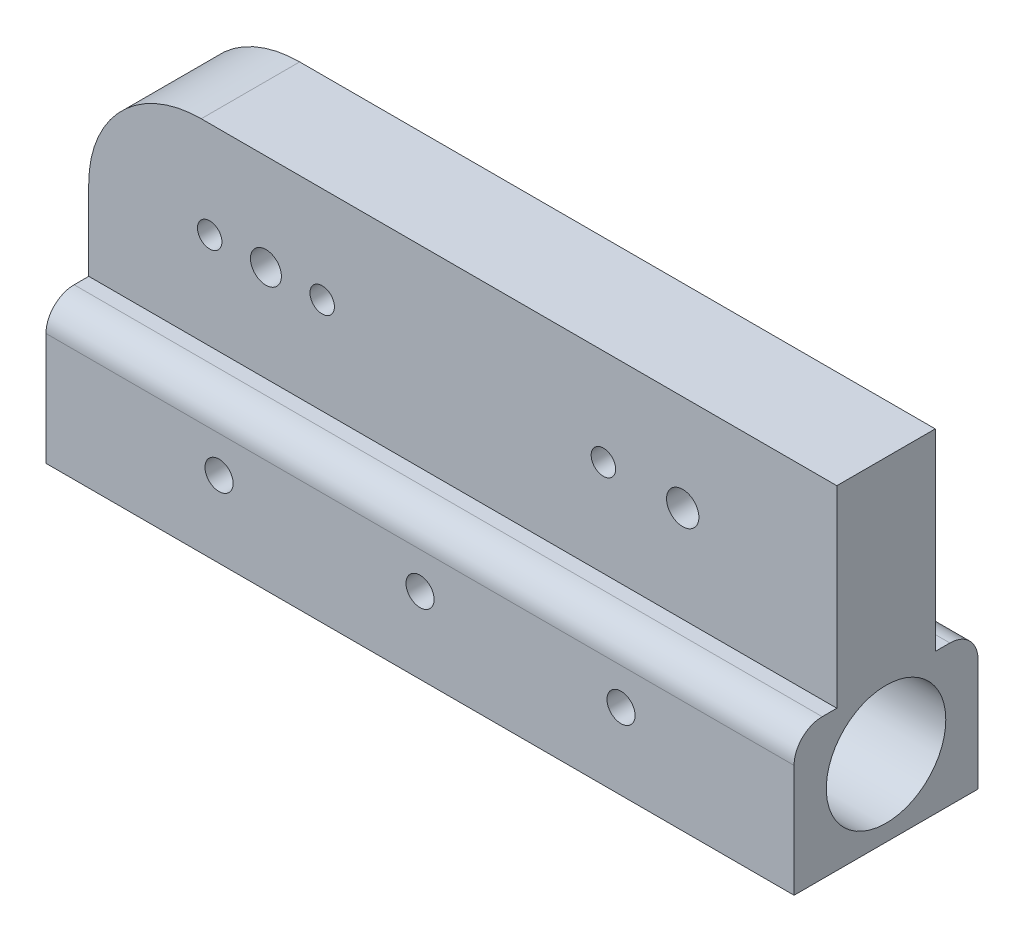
ISO-10303-21;
HEADER;
FILE_DESCRIPTION(('STEP AP214'),'2;1');
FILE_NAME('part.step','',(''),(''),'','','');
FILE_SCHEMA(('AUTOMOTIVE_DESIGN { 1 0 10303 214 1 1 1 1 }'));
ENDSEC;
DATA;
#1=APPLICATION_CONTEXT('core data for automotive mechanical design processes');
#2=APPLICATION_PROTOCOL_DEFINITION('international standard','automotive_design',2000,#1);
#3=PRODUCT_CONTEXT('',#1,'mechanical');
#4=PRODUCT('Part','Part','',(#3));
#5=PRODUCT_RELATED_PRODUCT_CATEGORY('part','',(#4));
#6=PRODUCT_DEFINITION_FORMATION('','',#4);
#7=PRODUCT_DEFINITION_CONTEXT('part definition',#1,'design');
#8=PRODUCT_DEFINITION('design','',#6,#7);
#9=PRODUCT_DEFINITION_SHAPE('','',#8);
#10=(LENGTH_UNIT() NAMED_UNIT(*) SI_UNIT(.MILLI.,.METRE.));
#11=(NAMED_UNIT(*) PLANE_ANGLE_UNIT() SI_UNIT($,.RADIAN.));
#12=(NAMED_UNIT(*) SI_UNIT($,.STERADIAN.) SOLID_ANGLE_UNIT());
#13=UNCERTAINTY_MEASURE_WITH_UNIT(LENGTH_MEASURE(1.E-05),#10,'distance_accuracy_value','');
#14=(GEOMETRIC_REPRESENTATION_CONTEXT(3) GLOBAL_UNCERTAINTY_ASSIGNED_CONTEXT((#13)) GLOBAL_UNIT_ASSIGNED_CONTEXT((#10,
#11,#12)) REPRESENTATION_CONTEXT('',''));
#15=CARTESIAN_POINT('',(0.,0.,0.));
#16=DIRECTION('',(0.,0.,1.));
#17=DIRECTION('',(1.,0.,0.));
#18=AXIS2_PLACEMENT_3D('',#15,#16,#17);
#19=CARTESIAN_POINT('',(-1.12942044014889,61.4334021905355,7.));
#20=DIRECTION('',(0.,0.,1.));
#21=DIRECTION('',(1.,0.,0.));
#22=AXIS2_PLACEMENT_3D('',#19,#20,#21);
#23=PLANE('',#22);
#24=CARTESIAN_POINT('',(27.471230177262,62.5801781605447,7.));
#25=DIRECTION('',(0.,0.,1.));
#26=DIRECTION('',(1.,0.,0.));
#27=AXIS2_PLACEMENT_3D('',#24,#25,#26);
#28=CIRCLE('',#27,0.870000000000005);
#29=CARTESIAN_POINT('',(28.341230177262,62.5801781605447,7.));
#30=VERTEX_POINT('',#29);
#31=EDGE_CURVE('E193',#30,#30,#28,.T.);
#32=ORIENTED_EDGE('',*,*,#31,.F.);
#33=EDGE_LOOP('',(#32));
#34=FACE_BOUND('',#33,.T.);
#35=CARTESIAN_POINT('',(3.47123017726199,62.5801781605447,7.));
#36=DIRECTION('',(0.,0.,1.));
#37=DIRECTION('',(1.,0.,0.));
#38=AXIS2_PLACEMENT_3D('',#35,#36,#37);
#39=CIRCLE('',#38,1.1);
#40=CARTESIAN_POINT('',(4.571230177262,62.5801781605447,7.));
#41=VERTEX_POINT('',#40);
#42=EDGE_CURVE('E205',#41,#41,#39,.T.);
#43=ORIENTED_EDGE('',*,*,#42,.F.);
#44=EDGE_LOOP('',(#43));
#45=FACE_BOUND('',#44,.T.);
#46=DIRECTION('',(0.,1.,0.));
#47=VECTOR('',#46,1.);
#48=CARTESIAN_POINT('',(44.0718807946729,55.726954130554,7.));
#49=LINE('',#48,#47);
#50=CARTESIAN_POINT('',(44.0718807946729,55.726954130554,7.));
#51=VERTEX_POINT('',#50);
#52=CARTESIAN_POINT('',(44.0718807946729,69.4334021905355,7.));
#53=VERTEX_POINT('',#52);
#54=EDGE_CURVE('E217',#51,#53,#49,.T.);
#55=ORIENTED_EDGE('',*,*,#54,.T.);
#56=DIRECTION('',(-1.,0.,0.));
#57=VECTOR('',#56,1.);
#58=CARTESIAN_POINT('',(-1.12942044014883,69.4334021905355,7.));
#59=LINE('',#58,#57);
#60=CARTESIAN_POINT('',(-1.12942044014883,69.4334021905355,7.));
#61=VERTEX_POINT('',#60);
#62=EDGE_CURVE('E83',#53,#61,#59,.T.);
#63=ORIENTED_EDGE('',*,*,#62,.T.);
#64=CARTESIAN_POINT('',(-1.12942044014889,61.4334021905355,7.));
#65=DIRECTION('',(0.,0.,1.));
#66=DIRECTION('',(1.,0.,0.));
#67=AXIS2_PLACEMENT_3D('',#64,#65,#66);
#68=CIRCLE('',#67,8.);
#69=CARTESIAN_POINT('',(-9.12942044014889,61.4334021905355,7.));
#70=VERTEX_POINT('',#69);
#71=EDGE_CURVE('E54',#61,#70,#68,.T.);
#72=ORIENTED_EDGE('',*,*,#71,.T.);
#73=DIRECTION('',(0.,-1.,0.));
#74=VECTOR('',#73,1.);
#75=CARTESIAN_POINT('',(-9.12942044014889,55.726954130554,7.));
#76=LINE('',#75,#74);
#77=CARTESIAN_POINT('',(-9.12942044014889,55.726954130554,7.));
#78=VERTEX_POINT('',#77);
#79=EDGE_CURVE('E222',#70,#78,#76,.T.);
#80=ORIENTED_EDGE('',*,*,#79,.T.);
#81=DIRECTION('',(1.,0.,0.));
#82=VECTOR('',#81,1.);
#83=CARTESIAN_POINT('',(-9.12942044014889,55.726954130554,7.));
#84=LINE('',#83,#82);
#85=EDGE_CURVE('E224',#78,#51,#84,.T.);
#86=ORIENTED_EDGE('',*,*,#85,.T.);
#87=EDGE_LOOP('',(#55,#63,#72,#80,#86));
#88=FACE_BOUND('',#87,.T.);
#89=CARTESIAN_POINT('',(-0.528769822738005,62.5801781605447,7.));
#90=DIRECTION('',(0.,0.,1.));
#91=DIRECTION('',(1.,0.,0.));
#92=AXIS2_PLACEMENT_3D('',#89,#90,#91);
#93=CIRCLE('',#92,0.869999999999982);
#94=CARTESIAN_POINT('',(0.341230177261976,62.5801781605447,7.));
#95=VERTEX_POINT('',#94);
#96=EDGE_CURVE('E211',#95,#95,#93,.T.);
#97=ORIENTED_EDGE('',*,*,#96,.F.);
#98=EDGE_LOOP('',(#97));
#99=FACE_BOUND('',#98,.T.);
#100=CARTESIAN_POINT('',(7.47123017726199,62.5801781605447,7.));
#101=DIRECTION('',(0.,0.,1.));
#102=DIRECTION('',(1.,0.,0.));
#103=AXIS2_PLACEMENT_3D('',#100,#101,#102);
#104=CIRCLE('',#103,0.870000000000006);
#105=CARTESIAN_POINT('',(8.341230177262,62.5801781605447,7.));
#106=VERTEX_POINT('',#105);
#107=EDGE_CURVE('E199',#106,#106,#104,.T.);
#108=ORIENTED_EDGE('',*,*,#107,.F.);
#109=EDGE_LOOP('',(#108));
#110=FACE_BOUND('',#109,.T.);
#111=CARTESIAN_POINT('',(33.111230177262,62.5801781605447,7.));
#112=DIRECTION('',(0.,0.,1.));
#113=DIRECTION('',(1.,0.,0.));
#114=AXIS2_PLACEMENT_3D('',#111,#112,#113);
#115=CIRCLE('',#114,1.15000000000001);
#116=CARTESIAN_POINT('',(34.261230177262,62.5801781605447,7.));
#117=VERTEX_POINT('',#116);
#118=EDGE_CURVE('E185',#117,#117,#115,.T.);
#119=ORIENTED_EDGE('',*,*,#118,.F.);
#120=EDGE_LOOP('',(#119));
#121=FACE_BOUND('',#120,.T.);
#122=ADVANCED_FACE('F32',(#34,#45,#88,#99,#110,#121),#23,.T.);
#123=CARTESIAN_POINT('',(-1.12942044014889,61.4334021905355,0.));
#124=DIRECTION('',(0.,0.,1.));
#125=DIRECTION('',(1.,0.,0.));
#126=AXIS2_PLACEMENT_3D('',#123,#124,#125);
#127=PLANE('',#126);
#128=CARTESIAN_POINT('',(27.471230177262,62.5801781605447,0.));
#129=DIRECTION('',(0.,0.,1.));
#130=DIRECTION('',(1.,0.,0.));
#131=AXIS2_PLACEMENT_3D('',#128,#129,#130);
#132=CIRCLE('',#131,0.870000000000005);
#133=CARTESIAN_POINT('',(28.341230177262,62.5801781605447,0.));
#134=VERTEX_POINT('',#133);
#135=EDGE_CURVE('E188',#134,#134,#132,.T.);
#136=ORIENTED_EDGE('',*,*,#135,.T.);
#137=EDGE_LOOP('',(#136));
#138=FACE_BOUND('',#137,.T.);
#139=CARTESIAN_POINT('',(3.47123017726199,62.5801781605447,0.));
#140=DIRECTION('',(0.,0.,1.));
#141=DIRECTION('',(1.,0.,0.));
#142=AXIS2_PLACEMENT_3D('',#139,#140,#141);
#143=CIRCLE('',#142,1.1);
#144=CARTESIAN_POINT('',(4.571230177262,62.5801781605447,0.));
#145=VERTEX_POINT('',#144);
#146=EDGE_CURVE('E202',#145,#145,#143,.T.);
#147=ORIENTED_EDGE('',*,*,#146,.T.);
#148=EDGE_LOOP('',(#147));
#149=FACE_BOUND('',#148,.T.);
#150=DIRECTION('',(0.,1.,0.));
#151=VECTOR('',#150,1.);
#152=CARTESIAN_POINT('',(44.0718807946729,55.726954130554,0.));
#153=LINE('',#152,#151);
#154=CARTESIAN_POINT('',(44.0718807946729,55.726954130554,0.));
#155=VERTEX_POINT('',#154);
#156=CARTESIAN_POINT('',(44.0718807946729,69.4334021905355,0.));
#157=VERTEX_POINT('',#156);
#158=EDGE_CURVE('E214',#155,#157,#153,.T.);
#159=ORIENTED_EDGE('',*,*,#158,.F.);
#160=DIRECTION('',(1.,0.,0.));
#161=VECTOR('',#160,1.);
#162=CARTESIAN_POINT('',(-9.12942044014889,55.726954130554,0.));
#163=LINE('',#162,#161);
#164=CARTESIAN_POINT('',(-9.12942044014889,55.726954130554,0.));
#165=VERTEX_POINT('',#164);
#166=EDGE_CURVE('E219',#165,#155,#163,.T.);
#167=ORIENTED_EDGE('',*,*,#166,.F.);
#168=DIRECTION('',(0.,-1.,0.));
#169=VECTOR('',#168,1.);
#170=CARTESIAN_POINT('',(-9.12942044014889,55.726954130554,0.));
#171=LINE('',#170,#169);
#172=CARTESIAN_POINT('',(-9.12942044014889,61.4334021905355,0.));
#173=VERTEX_POINT('',#172);
#174=EDGE_CURVE('E232',#173,#165,#171,.T.);
#175=ORIENTED_EDGE('',*,*,#174,.F.);
#176=CARTESIAN_POINT('',(-1.12942044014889,61.4334021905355,0.));
#177=DIRECTION('',(0.,0.,1.));
#178=DIRECTION('',(1.,0.,0.));
#179=AXIS2_PLACEMENT_3D('',#176,#177,#178);
#180=CIRCLE('',#179,8.);
#181=CARTESIAN_POINT('',(-1.12942044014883,69.4334021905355,0.));
#182=VERTEX_POINT('',#181);
#183=EDGE_CURVE('E71',#182,#173,#180,.T.);
#184=ORIENTED_EDGE('',*,*,#183,.F.);
#185=DIRECTION('',(-1.,0.,0.));
#186=VECTOR('',#185,1.);
#187=CARTESIAN_POINT('',(-1.12942044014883,69.4334021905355,0.));
#188=LINE('',#187,#186);
#189=EDGE_CURVE('E229',#157,#182,#188,.T.);
#190=ORIENTED_EDGE('',*,*,#189,.F.);
#191=EDGE_LOOP('',(#159,#167,#175,#184,#190));
#192=FACE_BOUND('',#191,.T.);
#193=CARTESIAN_POINT('',(-0.528769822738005,62.5801781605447,0.));
#194=DIRECTION('',(0.,0.,1.));
#195=DIRECTION('',(1.,0.,0.));
#196=AXIS2_PLACEMENT_3D('',#193,#194,#195);
#197=CIRCLE('',#196,0.869999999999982);
#198=CARTESIAN_POINT('',(0.341230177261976,62.5801781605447,0.));
#199=VERTEX_POINT('',#198);
#200=EDGE_CURVE('E208',#199,#199,#197,.T.);
#201=ORIENTED_EDGE('',*,*,#200,.T.);
#202=EDGE_LOOP('',(#201));
#203=FACE_BOUND('',#202,.T.);
#204=CARTESIAN_POINT('',(7.47123017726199,62.5801781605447,0.));
#205=DIRECTION('',(0.,0.,1.));
#206=DIRECTION('',(1.,0.,0.));
#207=AXIS2_PLACEMENT_3D('',#204,#205,#206);
#208=CIRCLE('',#207,0.870000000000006);
#209=CARTESIAN_POINT('',(8.341230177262,62.5801781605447,0.));
#210=VERTEX_POINT('',#209);
#211=EDGE_CURVE('E196',#210,#210,#208,.T.);
#212=ORIENTED_EDGE('',*,*,#211,.T.);
#213=EDGE_LOOP('',(#212));
#214=FACE_BOUND('',#213,.T.);
#215=CARTESIAN_POINT('',(33.111230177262,62.5801781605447,0.));
#216=DIRECTION('',(0.,0.,1.));
#217=DIRECTION('',(1.,0.,0.));
#218=AXIS2_PLACEMENT_3D('',#215,#216,#217);
#219=CIRCLE('',#218,1.15000000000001);
#220=CARTESIAN_POINT('',(34.261230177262,62.5801781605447,0.));
#221=VERTEX_POINT('',#220);
#222=EDGE_CURVE('E189',#221,#221,#219,.T.);
#223=ORIENTED_EDGE('',*,*,#222,.T.);
#224=EDGE_LOOP('',(#223));
#225=FACE_BOUND('',#224,.T.);
#226=ADVANCED_FACE('F240',(#138,#149,#192,#203,#214,#225),#127,.F.);
#227=CARTESIAN_POINT('',(44.0718807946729,55.726954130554,7.));
#228=DIRECTION('',(-1.,0.,0.));
#229=DIRECTION('',(0.,0.,1.));
#230=AXIS2_PLACEMENT_3D('',#227,#228,#229);
#231=PLANE('',#230);
#232=CARTESIAN_POINT('',(44.0718807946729,51.1435839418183,3.5));
#233=DIRECTION('',(1.,0.,0.));
#234=DIRECTION('',(0.,0.,-1.));
#235=AXIS2_PLACEMENT_3D('',#232,#233,#234);
#236=CIRCLE('',#235,4.25);
#237=CARTESIAN_POINT('',(44.0718807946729,51.1435839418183,-0.750000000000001));
#238=VERTEX_POINT('',#237);
#239=EDGE_CURVE('E356',#238,#238,#236,.T.);
#240=ORIENTED_EDGE('',*,*,#239,.F.);
#241=EDGE_LOOP('',(#240));
#242=FACE_BOUND('',#241,.T.);
#243=ORIENTED_EDGE('',*,*,#158,.T.);
#244=DIRECTION('',(0.,0.,-1.));
#245=VECTOR('',#244,1.);
#246=CARTESIAN_POINT('',(44.0718807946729,69.4334021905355,7.));
#247=LINE('',#246,#245);
#248=EDGE_CURVE('E11',#53,#157,#247,.T.);
#249=ORIENTED_EDGE('',*,*,#248,.F.);
#250=ORIENTED_EDGE('',*,*,#54,.F.);
#251=DIRECTION('',(0.,0.,1.));
#252=VECTOR('',#251,1.);
#253=CARTESIAN_POINT('',(44.0718807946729,55.726954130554,-1.03999999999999));
#254=LINE('',#253,#252);
#255=CARTESIAN_POINT('',(44.0718807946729,55.726954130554,8.03999999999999));
#256=VERTEX_POINT('',#255);
#257=EDGE_CURVE('E176',#51,#256,#254,.T.);
#258=ORIENTED_EDGE('',*,*,#257,.T.);
#259=CARTESIAN_POINT('',(44.0718807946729,53.726954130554,8.04));
#260=DIRECTION('',(-1.,0.,0.));
#261=DIRECTION('',(0.,0.,1.));
#262=AXIS2_PLACEMENT_3D('',#259,#260,#261);
#263=CIRCLE('',#262,2.);
#264=CARTESIAN_POINT('',(44.0718807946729,53.726954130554,10.04));
#265=VERTEX_POINT('',#264);
#266=EDGE_CURVE('E192',#256,#265,#263,.F.);
#267=ORIENTED_EDGE('',*,*,#266,.T.);
#268=DIRECTION('',(0.,-1.,0.));
#269=VECTOR('',#268,1.);
#270=CARTESIAN_POINT('',(44.0718807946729,53.726954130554,10.04));
#271=LINE('',#270,#269);
#272=CARTESIAN_POINT('',(44.0718807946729,45.726954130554,10.04));
#273=VERTEX_POINT('',#272);
#274=EDGE_CURVE('E139',#265,#273,#271,.T.);
#275=ORIENTED_EDGE('',*,*,#274,.T.);
#276=DIRECTION('',(0.,0.,-1.));
#277=VECTOR('',#276,1.);
#278=CARTESIAN_POINT('',(44.0718807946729,45.726954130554,-3.04));
#279=LINE('',#278,#277);
#280=CARTESIAN_POINT('',(44.0718807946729,45.726954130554,-3.04));
#281=VERTEX_POINT('',#280);
#282=EDGE_CURVE('E301',#273,#281,#279,.T.);
#283=ORIENTED_EDGE('',*,*,#282,.T.);
#284=DIRECTION('',(0.,1.,0.));
#285=VECTOR('',#284,1.);
#286=CARTESIAN_POINT('',(44.0718807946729,53.726954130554,-3.04));
#287=LINE('',#286,#285);
#288=CARTESIAN_POINT('',(44.0718807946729,53.726954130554,-3.04));
#289=VERTEX_POINT('',#288);
#290=EDGE_CURVE('E300',#281,#289,#287,.T.);
#291=ORIENTED_EDGE('',*,*,#290,.T.);
#292=CARTESIAN_POINT('',(44.0718807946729,53.726954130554,-1.04));
#293=DIRECTION('',(-1.,0.,0.));
#294=DIRECTION('',(0.,0.,1.));
#295=AXIS2_PLACEMENT_3D('',#292,#293,#294);
#296=CIRCLE('',#295,2.);
#297=CARTESIAN_POINT('',(44.0718807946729,55.726954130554,-1.03999999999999));
#298=VERTEX_POINT('',#297);
#299=EDGE_CURVE('E298',#289,#298,#296,.F.);
#300=ORIENTED_EDGE('',*,*,#299,.T.);
#301=EDGE_CURVE('E78',#298,#155,#254,.T.);
#302=ORIENTED_EDGE('',*,*,#301,.T.);
#303=EDGE_LOOP('',(#243,#249,#250,#258,#267,#275,#283,#291,#300,#302));
#304=FACE_BOUND('',#303,.T.);
#305=ADVANCED_FACE('F34',(#242,#304),#231,.F.);
#306=CARTESIAN_POINT('',(-1.12942044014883,69.4334021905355,7.));
#307=DIRECTION('',(0.,-1.,0.));
#308=DIRECTION('',(0.,0.,-1.));
#309=AXIS2_PLACEMENT_3D('',#306,#307,#308);
#310=PLANE('',#309);
#311=ORIENTED_EDGE('',*,*,#189,.T.);
#312=DIRECTION('',(0.,0.,-1.));
#313=VECTOR('',#312,1.);
#314=CARTESIAN_POINT('',(-1.12942044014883,69.4334021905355,7.));
#315=LINE('',#314,#313);
#316=EDGE_CURVE('E46',#61,#182,#315,.T.);
#317=ORIENTED_EDGE('',*,*,#316,.F.);
#318=ORIENTED_EDGE('',*,*,#62,.F.);
#319=ORIENTED_EDGE('',*,*,#248,.T.);
#320=EDGE_LOOP('',(#311,#317,#318,#319));
#321=FACE_BOUND('',#320,.T.);
#322=ADVANCED_FACE('F248',(#321),#310,.F.);
#323=CARTESIAN_POINT('',(-1.12942044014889,61.4334021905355,7.));
#324=DIRECTION('',(0.,0.,-1.));
#325=DIRECTION('',(-1.,0.,0.));
#326=AXIS2_PLACEMENT_3D('',#323,#324,#325);
#327=CYLINDRICAL_SURFACE('',#326,8.);
#328=ORIENTED_EDGE('',*,*,#183,.T.);
#329=DIRECTION('',(0.,0.,-1.));
#330=VECTOR('',#329,1.);
#331=CARTESIAN_POINT('',(-9.12942044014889,61.4334021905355,7.));
#332=LINE('',#331,#330);
#333=EDGE_CURVE('E227',#70,#173,#332,.T.);
#334=ORIENTED_EDGE('',*,*,#333,.F.);
#335=ORIENTED_EDGE('',*,*,#71,.F.);
#336=ORIENTED_EDGE('',*,*,#316,.T.);
#337=EDGE_LOOP('',(#328,#334,#335,#336));
#338=FACE_BOUND('',#337,.T.);
#339=ADVANCED_FACE('F236',(#338),#327,.T.);
#340=CARTESIAN_POINT('',(-9.12942044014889,55.726954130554,7.));
#341=DIRECTION('',(1.,0.,0.));
#342=DIRECTION('',(0.,0.,-1.));
#343=AXIS2_PLACEMENT_3D('',#340,#341,#342);
#344=PLANE('',#343);
#345=CARTESIAN_POINT('',(-9.12942044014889,51.1435839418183,3.5));
#346=DIRECTION('',(1.,0.,0.));
#347=DIRECTION('',(0.,0.,-1.));
#348=AXIS2_PLACEMENT_3D('',#345,#346,#347);
#349=CIRCLE('',#348,4.25);
#350=CARTESIAN_POINT('',(-9.12942044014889,51.1435839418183,-0.750000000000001));
#351=VERTEX_POINT('',#350);
#352=EDGE_CURVE('E279',#351,#351,#349,.T.);
#353=ORIENTED_EDGE('',*,*,#352,.T.);
#354=EDGE_LOOP('',(#353));
#355=FACE_BOUND('',#354,.T.);
#356=ORIENTED_EDGE('',*,*,#174,.T.);
#357=DIRECTION('',(0.,0.,-1.));
#358=VECTOR('',#357,1.);
#359=CARTESIAN_POINT('',(-9.12942044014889,55.726954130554,-1.03999999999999));
#360=LINE('',#359,#358);
#361=CARTESIAN_POINT('',(-9.12942044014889,55.726954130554,-1.03999999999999));
#362=VERTEX_POINT('',#361);
#363=EDGE_CURVE('E152',#165,#362,#360,.T.);
#364=ORIENTED_EDGE('',*,*,#363,.T.);
#365=CARTESIAN_POINT('',(-9.12942044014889,53.726954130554,-1.04));
#366=DIRECTION('',(-1.,0.,0.));
#367=DIRECTION('',(0.,0.,1.));
#368=AXIS2_PLACEMENT_3D('',#365,#366,#367);
#369=CIRCLE('',#368,2.);
#370=CARTESIAN_POINT('',(-9.12942044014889,53.726954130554,-3.04));
#371=VERTEX_POINT('',#370);
#372=EDGE_CURVE('E168',#362,#371,#369,.T.);
#373=ORIENTED_EDGE('',*,*,#372,.T.);
#374=DIRECTION('',(0.,-1.,0.));
#375=VECTOR('',#374,1.);
#376=CARTESIAN_POINT('',(-9.12942044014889,53.726954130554,-3.04));
#377=LINE('',#376,#375);
#378=CARTESIAN_POINT('',(-9.12942044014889,45.726954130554,-3.04));
#379=VERTEX_POINT('',#378);
#380=EDGE_CURVE('E171',#371,#379,#377,.T.);
#381=ORIENTED_EDGE('',*,*,#380,.T.);
#382=DIRECTION('',(0.,0.,1.));
#383=VECTOR('',#382,1.);
#384=CARTESIAN_POINT('',(-9.12942044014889,45.726954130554,-3.04));
#385=LINE('',#384,#383);
#386=CARTESIAN_POINT('',(-9.12942044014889,45.726954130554,10.04));
#387=VERTEX_POINT('',#386);
#388=EDGE_CURVE('E143',#379,#387,#385,.T.);
#389=ORIENTED_EDGE('',*,*,#388,.T.);
#390=DIRECTION('',(0.,1.,0.));
#391=VECTOR('',#390,1.);
#392=CARTESIAN_POINT('',(-9.12942044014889,53.726954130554,10.04));
#393=LINE('',#392,#391);
#394=CARTESIAN_POINT('',(-9.12942044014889,53.726954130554,10.04));
#395=VERTEX_POINT('',#394);
#396=EDGE_CURVE('E137',#387,#395,#393,.T.);
#397=ORIENTED_EDGE('',*,*,#396,.T.);
#398=CARTESIAN_POINT('',(-9.12942044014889,53.726954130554,8.04));
#399=DIRECTION('',(-1.,0.,0.));
#400=DIRECTION('',(0.,0.,1.));
#401=AXIS2_PLACEMENT_3D('',#398,#399,#400);
#402=CIRCLE('',#401,2.);
#403=CARTESIAN_POINT('',(-9.12942044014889,55.726954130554,8.03999999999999));
#404=VERTEX_POINT('',#403);
#405=EDGE_CURVE('E146',#395,#404,#402,.T.);
#406=ORIENTED_EDGE('',*,*,#405,.T.);
#407=EDGE_CURVE('E166',#404,#78,#360,.T.);
#408=ORIENTED_EDGE('',*,*,#407,.T.);
#409=ORIENTED_EDGE('',*,*,#79,.F.);
#410=ORIENTED_EDGE('',*,*,#333,.T.);
#411=EDGE_LOOP('',(#356,#364,#373,#381,#389,#397,#406,#408,#409,#410));
#412=FACE_BOUND('',#411,.T.);
#413=ADVANCED_FACE('F155',(#355,#412),#344,.F.);
#414=CARTESIAN_POINT('',(-0.528769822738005,62.5801781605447,7.));
#415=DIRECTION('',(0.,0.,-1.));
#416=DIRECTION('',(-1.,0.,0.));
#417=AXIS2_PLACEMENT_3D('',#414,#415,#416);
#418=CYLINDRICAL_SURFACE('',#417,0.869999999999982);
#419=ORIENTED_EDGE('',*,*,#96,.T.);
#420=EDGE_LOOP('',(#419));
#421=FACE_BOUND('',#420,.T.);
#422=ORIENTED_EDGE('',*,*,#200,.F.);
#423=EDGE_LOOP('',(#422));
#424=FACE_BOUND('',#423,.T.);
#425=ADVANCED_FACE('F267',(#421,#424),#418,.F.);
#426=CARTESIAN_POINT('',(3.47123017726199,62.5801781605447,7.));
#427=DIRECTION('',(0.,0.,-1.));
#428=DIRECTION('',(-1.,0.,0.));
#429=AXIS2_PLACEMENT_3D('',#426,#427,#428);
#430=CYLINDRICAL_SURFACE('',#429,1.1);
#431=ORIENTED_EDGE('',*,*,#42,.T.);
#432=EDGE_LOOP('',(#431));
#433=FACE_BOUND('',#432,.T.);
#434=ORIENTED_EDGE('',*,*,#146,.F.);
#435=EDGE_LOOP('',(#434));
#436=FACE_BOUND('',#435,.T.);
#437=ADVANCED_FACE('F275',(#433,#436),#430,.F.);
#438=CARTESIAN_POINT('',(7.47123017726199,62.5801781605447,7.));
#439=DIRECTION('',(0.,0.,-1.));
#440=DIRECTION('',(-1.,0.,0.));
#441=AXIS2_PLACEMENT_3D('',#438,#439,#440);
#442=CYLINDRICAL_SURFACE('',#441,0.870000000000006);
#443=ORIENTED_EDGE('',*,*,#107,.T.);
#444=EDGE_LOOP('',(#443));
#445=FACE_BOUND('',#444,.T.);
#446=ORIENTED_EDGE('',*,*,#211,.F.);
#447=EDGE_LOOP('',(#446));
#448=FACE_BOUND('',#447,.T.);
#449=ADVANCED_FACE('F391',(#445,#448),#442,.F.);
#450=CARTESIAN_POINT('',(27.471230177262,62.5801781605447,7.));
#451=DIRECTION('',(0.,0.,-1.));
#452=DIRECTION('',(-1.,0.,0.));
#453=AXIS2_PLACEMENT_3D('',#450,#451,#452);
#454=CYLINDRICAL_SURFACE('',#453,0.870000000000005);
#455=ORIENTED_EDGE('',*,*,#31,.T.);
#456=EDGE_LOOP('',(#455));
#457=FACE_BOUND('',#456,.T.);
#458=ORIENTED_EDGE('',*,*,#135,.F.);
#459=EDGE_LOOP('',(#458));
#460=FACE_BOUND('',#459,.T.);
#461=ADVANCED_FACE('F327',(#457,#460),#454,.F.);
#462=CARTESIAN_POINT('',(33.111230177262,62.5801781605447,7.));
#463=DIRECTION('',(0.,0.,-1.));
#464=DIRECTION('',(-1.,0.,0.));
#465=AXIS2_PLACEMENT_3D('',#462,#463,#464);
#466=CYLINDRICAL_SURFACE('',#465,1.15000000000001);
#467=ORIENTED_EDGE('',*,*,#118,.T.);
#468=EDGE_LOOP('',(#467));
#469=FACE_BOUND('',#468,.T.);
#470=ORIENTED_EDGE('',*,*,#222,.F.);
#471=EDGE_LOOP('',(#470));
#472=FACE_BOUND('',#471,.T.);
#473=ADVANCED_FACE('F319',(#469,#472),#466,.F.);
#474=CARTESIAN_POINT('',(60.5365824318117,55.726954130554,-1.03999999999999));
#475=DIRECTION('',(0.,1.,0.));
#476=DIRECTION('',(0.,0.,1.));
#477=AXIS2_PLACEMENT_3D('',#474,#475,#476);
#478=PLANE('',#477);
#479=ORIENTED_EDGE('',*,*,#166,.T.);
#480=ORIENTED_EDGE('',*,*,#301,.F.);
#481=DIRECTION('',(-1.,0.,0.));
#482=VECTOR('',#481,1.);
#483=CARTESIAN_POINT('',(60.5365824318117,55.726954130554,-1.03999999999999));
#484=LINE('',#483,#482);
#485=EDGE_CURVE('E181',#298,#362,#484,.T.);
#486=ORIENTED_EDGE('',*,*,#485,.T.);
#487=ORIENTED_EDGE('',*,*,#363,.F.);
#488=EDGE_LOOP('',(#479,#480,#486,#487));
#489=FACE_BOUND('',#488,.T.);
#490=ADVANCED_FACE('F317',(#489),#478,.T.);
#491=CARTESIAN_POINT('',(60.5365824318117,53.726954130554,8.04));
#492=DIRECTION('',(-1.,0.,0.));
#493=DIRECTION('',(0.,0.,1.));
#494=AXIS2_PLACEMENT_3D('',#491,#492,#493);
#495=CYLINDRICAL_SURFACE('',#494,2.);
#496=ORIENTED_EDGE('',*,*,#266,.F.);
#497=DIRECTION('',(-1.,0.,0.));
#498=VECTOR('',#497,1.);
#499=CARTESIAN_POINT('',(60.5365824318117,55.726954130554,8.03999999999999));
#500=LINE('',#499,#498);
#501=EDGE_CURVE('E142',#256,#404,#500,.T.);
#502=ORIENTED_EDGE('',*,*,#501,.T.);
#503=ORIENTED_EDGE('',*,*,#405,.F.);
#504=DIRECTION('',(-1.,0.,0.));
#505=VECTOR('',#504,1.);
#506=CARTESIAN_POINT('',(60.5365824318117,53.726954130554,10.04));
#507=LINE('',#506,#505);
#508=EDGE_CURVE('E132',#265,#395,#507,.T.);
#509=ORIENTED_EDGE('',*,*,#508,.F.);
#510=EDGE_LOOP('',(#496,#502,#503,#509));
#511=FACE_BOUND('',#510,.T.);
#512=ADVANCED_FACE('F147',(#511),#495,.T.);
#513=ORIENTED_EDGE('',*,*,#257,.F.);
#514=ORIENTED_EDGE('',*,*,#85,.F.);
#515=ORIENTED_EDGE('',*,*,#407,.F.);
#516=ORIENTED_EDGE('',*,*,#501,.F.);
#517=EDGE_LOOP('',(#513,#514,#515,#516));
#518=FACE_BOUND('',#517,.T.);
#519=ADVANCED_FACE('F321',(#518),#478,.T.);
#520=CARTESIAN_POINT('',(60.5365824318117,53.726954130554,-1.04));
#521=DIRECTION('',(-1.,0.,0.));
#522=DIRECTION('',(0.,0.,1.));
#523=AXIS2_PLACEMENT_3D('',#520,#521,#522);
#524=CYLINDRICAL_SURFACE('',#523,2.);
#525=ORIENTED_EDGE('',*,*,#299,.F.);
#526=DIRECTION('',(-1.,0.,0.));
#527=VECTOR('',#526,1.);
#528=CARTESIAN_POINT('',(60.5365824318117,53.726954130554,-3.04));
#529=LINE('',#528,#527);
#530=EDGE_CURVE('E179',#289,#371,#529,.T.);
#531=ORIENTED_EDGE('',*,*,#530,.T.);
#532=ORIENTED_EDGE('',*,*,#372,.F.);
#533=ORIENTED_EDGE('',*,*,#485,.F.);
#534=EDGE_LOOP('',(#525,#531,#532,#533));
#535=FACE_BOUND('',#534,.T.);
#536=ADVANCED_FACE('F315',(#535),#524,.T.);
#537=CARTESIAN_POINT('',(60.5365824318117,53.726954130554,-3.04));
#538=DIRECTION('',(0.,0.,-1.));
#539=DIRECTION('',(0.,1.,0.));
#540=AXIS2_PLACEMENT_3D('',#537,#538,#539);
#541=PLANE('',#540);
#542=ORIENTED_EDGE('',*,*,#290,.F.);
#543=DIRECTION('',(-1.,0.,0.));
#544=VECTOR('',#543,1.);
#545=CARTESIAN_POINT('',(60.5365824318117,45.726954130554,-3.04));
#546=LINE('',#545,#544);
#547=EDGE_CURVE('E177',#281,#379,#546,.T.);
#548=ORIENTED_EDGE('',*,*,#547,.T.);
#549=ORIENTED_EDGE('',*,*,#380,.F.);
#550=ORIENTED_EDGE('',*,*,#530,.F.);
#551=EDGE_LOOP('',(#542,#548,#549,#550));
#552=FACE_BOUND('',#551,.T.);
#553=ADVANCED_FACE('F309',(#552),#541,.T.);
#554=CARTESIAN_POINT('',(60.5365824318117,45.726954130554,-3.04));
#555=DIRECTION('',(0.,-1.,0.));
#556=DIRECTION('',(0.,0.,-1.));
#557=AXIS2_PLACEMENT_3D('',#554,#555,#556);
#558=PLANE('',#557);
#559=ORIENTED_EDGE('',*,*,#282,.F.);
#560=DIRECTION('',(-1.,0.,0.));
#561=VECTOR('',#560,1.);
#562=CARTESIAN_POINT('',(60.5365824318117,45.726954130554,10.04));
#563=LINE('',#562,#561);
#564=EDGE_CURVE('E174',#273,#387,#563,.T.);
#565=ORIENTED_EDGE('',*,*,#564,.T.);
#566=ORIENTED_EDGE('',*,*,#388,.F.);
#567=ORIENTED_EDGE('',*,*,#547,.F.);
#568=EDGE_LOOP('',(#559,#565,#566,#567));
#569=FACE_BOUND('',#568,.T.);
#570=ADVANCED_FACE('F306',(#569),#558,.T.);
#571=CARTESIAN_POINT('',(60.5365824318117,53.726954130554,10.04));
#572=DIRECTION('',(0.,0.,1.));
#573=DIRECTION('',(1.,0.,0.));
#574=AXIS2_PLACEMENT_3D('',#571,#572,#573);
#575=PLANE('',#574);
#576=CARTESIAN_POINT('',(17.471230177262,51.1435839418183,10.04));
#577=DIRECTION('',(0.,0.,1.));
#578=DIRECTION('',(1.,0.,0.));
#579=AXIS2_PLACEMENT_3D('',#576,#577,#578);
#580=CIRCLE('',#579,1.);
#581=CARTESIAN_POINT('',(18.471230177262,51.1435839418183,10.04));
#582=VERTEX_POINT('',#581);
#583=EDGE_CURVE('E281',#582,#582,#580,.T.);
#584=ORIENTED_EDGE('',*,*,#583,.F.);
#585=EDGE_LOOP('',(#584));
#586=FACE_BOUND('',#585,.T.);
#587=CARTESIAN_POINT('',(3.17779142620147,51.1435839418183,10.04));
#588=DIRECTION('',(0.,0.,1.));
#589=DIRECTION('',(1.,0.,0.));
#590=AXIS2_PLACEMENT_3D('',#587,#588,#589);
#591=CIRCLE('',#590,1.);
#592=CARTESIAN_POINT('',(4.17779142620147,51.1435839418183,10.04));
#593=VERTEX_POINT('',#592);
#594=EDGE_CURVE('E161',#593,#593,#591,.T.);
#595=ORIENTED_EDGE('',*,*,#594,.F.);
#596=EDGE_LOOP('',(#595));
#597=FACE_BOUND('',#596,.T.);
#598=CARTESIAN_POINT('',(31.7646689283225,51.1435839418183,10.04));
#599=DIRECTION('',(0.,0.,1.));
#600=DIRECTION('',(-1.,0.,0.));
#601=AXIS2_PLACEMENT_3D('',#598,#599,#600);
#602=CIRCLE('',#601,0.999999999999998);
#603=CARTESIAN_POINT('',(30.7646689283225,51.1435839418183,10.04));
#604=VERTEX_POINT('',#603);
#605=EDGE_CURVE('E158',#604,#604,#602,.T.);
#606=ORIENTED_EDGE('',*,*,#605,.F.);
#607=EDGE_LOOP('',(#606));
#608=FACE_BOUND('',#607,.T.);
#609=ORIENTED_EDGE('',*,*,#274,.F.);
#610=ORIENTED_EDGE('',*,*,#508,.T.);
#611=ORIENTED_EDGE('',*,*,#396,.F.);
#612=ORIENTED_EDGE('',*,*,#564,.F.);
#613=EDGE_LOOP('',(#609,#610,#611,#612));
#614=FACE_BOUND('',#613,.T.);
#615=ADVANCED_FACE('F134',(#586,#597,#608,#614),#575,.T.);
#616=CARTESIAN_POINT('',(31.7646689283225,51.1435839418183,4.04));
#617=DIRECTION('',(0.,0.,1.));
#618=DIRECTION('',(1.,0.,0.));
#619=AXIS2_PLACEMENT_3D('',#616,#617,#618);
#620=CYLINDRICAL_SURFACE('',#619,0.999999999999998);
#621=CARTESIAN_POINT('',(32.7646689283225,51.1435839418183,7.75));
#622=CARTESIAN_POINT('',(32.7646672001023,51.0882303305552,7.74999900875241));
#623=CARTESIAN_POINT('',(32.7600574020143,51.0328566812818,7.74890770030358));
#624=CARTESIAN_POINT('',(32.7417634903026,50.9236895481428,7.74465982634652));
#625=CARTESIAN_POINT('',(32.7280735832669,50.8698970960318,7.74150194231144));
#626=CARTESIAN_POINT('',(32.6920777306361,50.7654851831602,7.73347154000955));
#627=CARTESIAN_POINT('',(32.6697814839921,50.7148622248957,7.72860095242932));
#628=CARTESIAN_POINT('',(32.6172383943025,50.6180761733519,7.7176672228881));
#629=CARTESIAN_POINT('',(32.5869915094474,50.5719131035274,7.71160407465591));
#630=CARTESIAN_POINT('',(32.518817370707,50.4845070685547,7.69882163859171));
#631=CARTESIAN_POINT('',(32.480771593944,50.4433578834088,7.69209317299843));
#632=CARTESIAN_POINT('',(32.3983337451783,50.3679618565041,7.67880117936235));
#633=CARTESIAN_POINT('',(32.3539410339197,50.3337157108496,7.67223766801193));
#634=CARTESIAN_POINT('',(32.2593581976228,50.2726701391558,7.65992723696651));
#635=CARTESIAN_POINT('',(32.2091002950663,50.2459731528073,7.6541920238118));
#636=CARTESIAN_POINT('',(32.1046537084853,50.2014416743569,7.64432041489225));
#637=CARTESIAN_POINT('',(32.0504655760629,50.1836059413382,7.64018379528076));
#638=CARTESIAN_POINT('',(31.9407213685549,50.1576183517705,7.63407167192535));
#639=CARTESIAN_POINT('',(31.8852070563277,50.1492991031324,7.63205886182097));
#640=CARTESIAN_POINT('',(31.7735370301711,50.142059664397,7.63031041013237));
#641=CARTESIAN_POINT('',(31.7173814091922,50.1431381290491,7.63057444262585));
#642=CARTESIAN_POINT('',(31.6072867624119,50.1545293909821,7.63331619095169));
#643=CARTESIAN_POINT('',(31.5533259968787,50.1646451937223,7.63574668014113));
#644=CARTESIAN_POINT('',(31.4478896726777,50.1935107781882,7.64247251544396));
#645=CARTESIAN_POINT('',(31.3964142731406,50.212261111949,7.64676798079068));
#646=CARTESIAN_POINT('',(31.2968692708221,50.2580376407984,7.65678466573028));
#647=CARTESIAN_POINT('',(31.2488348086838,50.2851373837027,7.66251846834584));
#648=CARTESIAN_POINT('',(31.1579233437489,50.3467919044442,7.6747583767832));
#649=CARTESIAN_POINT('',(31.1150471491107,50.3813478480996,7.68126460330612));
#650=CARTESIAN_POINT('',(31.0345377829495,50.4579651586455,7.69451697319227));
#651=CARTESIAN_POINT('',(30.9970635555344,50.5001933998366,7.70126503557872));
#652=CARTESIAN_POINT('',(30.9297005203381,50.5904138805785,7.71409251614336));
#653=CARTESIAN_POINT('',(30.8998118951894,50.6384062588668,7.72017191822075));
#654=CARTESIAN_POINT('',(30.8484195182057,50.7390034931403,7.73100197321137));
#655=CARTESIAN_POINT('',(30.8269391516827,50.7916207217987,7.73574891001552));
#656=CARTESIAN_POINT('',(30.793170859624,50.899855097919,7.74335192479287));
#657=CARTESIAN_POINT('',(30.7808813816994,50.9554717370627,7.74620832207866));
#658=CARTESIAN_POINT('',(30.7660808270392,51.0667651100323,7.74966203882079));
#659=CARTESIAN_POINT('',(30.7633529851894,51.1224115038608,7.75030942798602));
#660=CARTESIAN_POINT('',(30.7671620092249,51.2333651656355,7.74941367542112));
#661=CARTESIAN_POINT('',(30.7736981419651,51.2886724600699,7.74787070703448));
#662=CARTESIAN_POINT('',(30.7956703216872,51.3966417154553,7.74279946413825));
#663=CARTESIAN_POINT('',(30.8109903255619,51.4493286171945,7.73929708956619));
#664=CARTESIAN_POINT('',(30.8499646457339,51.5513835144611,7.73070023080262));
#665=CARTESIAN_POINT('',(30.8736197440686,51.6007511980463,7.72560559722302));
#666=CARTESIAN_POINT('',(30.9290280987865,51.6956452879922,7.71426752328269));
#667=CARTESIAN_POINT('',(30.9609056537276,51.741097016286,7.70800690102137));
#668=CARTESIAN_POINT('',(31.0316928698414,51.8260834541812,7.69506204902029));
#669=CARTESIAN_POINT('',(31.0706035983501,51.8656172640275,7.68837775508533));
#670=CARTESIAN_POINT('',(31.1553538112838,51.9385215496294,7.67516216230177));
#671=CARTESIAN_POINT('',(31.2013245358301,51.9717408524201,7.6686372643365));
#672=CARTESIAN_POINT('',(31.2983181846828,52.0299905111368,7.65664183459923));
#673=CARTESIAN_POINT('',(31.349340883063,52.0550212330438,7.65117125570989));
#674=CARTESIAN_POINT('',(31.4547114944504,52.0960031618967,7.64196077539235));
#675=CARTESIAN_POINT('',(31.5090377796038,52.1120075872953,7.63821075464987));
#676=CARTESIAN_POINT('',(31.6197099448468,52.1346315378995,7.63285159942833));
#677=CARTESIAN_POINT('',(31.6760554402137,52.1412528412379,7.63124205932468));
#678=CARTESIAN_POINT('',(31.7876354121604,52.1448378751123,7.63037446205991));
#679=CARTESIAN_POINT('',(31.8428618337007,52.1420422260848,7.63105781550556));
#680=CARTESIAN_POINT('',(31.952032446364,52.1274172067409,7.63456498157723));
#681=CARTESIAN_POINT('',(32.0059766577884,52.1155879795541,7.63738876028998));
#682=CARTESIAN_POINT('',(32.1108241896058,52.0833558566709,7.64482789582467));
#683=CARTESIAN_POINT('',(32.161740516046,52.0629931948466,7.64943483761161));
#684=CARTESIAN_POINT('',(32.2594680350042,52.0143050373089,7.65992334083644));
#685=CARTESIAN_POINT('',(32.3062787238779,51.9859785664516,7.6658050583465));
#686=CARTESIAN_POINT('',(32.395640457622,51.9213913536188,7.67835132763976));
#687=CARTESIAN_POINT('',(32.4380671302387,51.8849614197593,7.68503090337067));
#688=CARTESIAN_POINT('',(32.516283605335,51.805537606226,7.6983253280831));
#689=CARTESIAN_POINT('',(32.5520718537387,51.7625421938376,7.70494016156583));
#690=CARTESIAN_POINT('',(32.6165333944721,51.6704019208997,7.71748213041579));
#691=CARTESIAN_POINT('',(32.6450875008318,51.621171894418,7.72339698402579));
#692=CARTESIAN_POINT('',(32.6934693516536,51.5184786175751,7.73374635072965));
#693=CARTESIAN_POINT('',(32.7133038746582,51.4650186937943,7.73818201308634));
#694=CARTESIAN_POINT('',(32.7404491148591,51.3669122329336,7.74435077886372));
#695=CARTESIAN_POINT('',(32.7495130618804,51.3227657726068,7.74645539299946));
#696=CARTESIAN_POINT('',(32.7616234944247,51.2336119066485,7.74928036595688));
#697=CARTESIAN_POINT('',(32.7646703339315,51.1886045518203,7.75000080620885));
#698=CARTESIAN_POINT('',(32.7646689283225,51.1435839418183,7.75));
#699=B_SPLINE_CURVE_WITH_KNOTS('',3,(#621,#622,#623,#624,#625,#626,#627,#628,#629,#630,#631,
#632,#633,#634,#635,#636,#637,#638,#639,#640,#641,#642,#643,#644,#645,#646,#647,#648,#649,#650,
#651,#652,#653,#654,#655,#656,#657,#658,#659,#660,#661,#662,#663,#664,#665,#666,#667,#668,#669,
#670,#671,#672,#673,#674,#675,#676,#677,#678,#679,#680,#681,#682,#683,#684,#685,#686,#687,#688,
#689,#690,#691,#692,#693,#694,#695,#696,#697,#698),.UNSPECIFIED.,.T.,.F.,(4,2,2,2,2,2,2,2,2,2,2,
2,2,2,2,2,2,2,2,2,2,2,2,2,2,2,2,2,2,2,2,2,2,2,2,2,2,2,4),(0.,0.16589594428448,0.331897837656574,
0.497713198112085,0.663529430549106,0.832082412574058,1.00065238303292,1.17141062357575,
1.34214494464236,1.50982754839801,1.67748614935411,1.84157698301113,2.00567830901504,
2.17126861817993,2.33688483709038,2.50666545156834,2.67645015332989,2.84670376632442,
3.01692861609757,3.18326853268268,3.34959528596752,3.51377373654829,3.67796759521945,
3.84480609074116,4.01166992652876,4.18212954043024,4.35258153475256,4.52201775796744,
4.69142186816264,4.85653056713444,5.02163665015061,5.18597288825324,5.35032925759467,
5.51850771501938,5.68672549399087,5.85755690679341,6.02825528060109,6.16319093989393,
6.29811866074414),.UNSPECIFIED.);
#700=CARTESIAN_POINT('',(32.7646689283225,51.1435839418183,7.75));
#701=VERTEX_POINT('',#700);
#702=EDGE_CURVE('E282',#701,#701,#699,.T.);
#703=ORIENTED_EDGE('',*,*,#702,.T.);
#704=EDGE_LOOP('',(#703));
#705=FACE_BOUND('',#704,.T.);
#706=ORIENTED_EDGE('',*,*,#605,.T.);
#707=EDGE_LOOP('',(#706));
#708=FACE_BOUND('',#707,.T.);
#709=ADVANCED_FACE('F341',(#705,#708),#620,.F.);
#710=CARTESIAN_POINT('',(3.17779142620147,51.1435839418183,4.04));
#711=DIRECTION('',(0.,0.,1.));
#712=DIRECTION('',(1.,0.,0.));
#713=AXIS2_PLACEMENT_3D('',#710,#711,#712);
#714=CYLINDRICAL_SURFACE('',#713,1.);
#715=CARTESIAN_POINT('',(4.17779142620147,51.1435839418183,7.75));
#716=CARTESIAN_POINT('',(4.17778969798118,51.0882303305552,7.74999900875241));
#717=CARTESIAN_POINT('',(4.17317989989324,51.0328566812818,7.74890770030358));
#718=CARTESIAN_POINT('',(4.15488598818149,50.9236895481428,7.74465982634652));
#719=CARTESIAN_POINT('',(4.14119608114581,50.8698970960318,7.74150194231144));
#720=CARTESIAN_POINT('',(4.10520022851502,50.7654851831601,7.73347154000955));
#721=CARTESIAN_POINT('',(4.08290398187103,50.7148622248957,7.72860095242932));
#722=CARTESIAN_POINT('',(4.03036089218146,50.6180761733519,7.7176672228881));
#723=CARTESIAN_POINT('',(4.00011400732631,50.5719131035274,7.71160407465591));
#724=CARTESIAN_POINT('',(3.93193986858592,50.4845070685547,7.69882163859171));
#725=CARTESIAN_POINT('',(3.89389409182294,50.4433578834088,7.69209317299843));
#726=CARTESIAN_POINT('',(3.81145624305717,50.3679618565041,7.67880117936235));
#727=CARTESIAN_POINT('',(3.76706353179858,50.3337157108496,7.67223766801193));
#728=CARTESIAN_POINT('',(3.67248069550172,50.2726701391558,7.6599272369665));
#729=CARTESIAN_POINT('',(3.62222279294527,50.2459731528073,7.6541920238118));
#730=CARTESIAN_POINT('',(3.5177762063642,50.2014416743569,7.64432041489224));
#731=CARTESIAN_POINT('',(3.46358807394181,50.1836059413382,7.64018379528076));
#732=CARTESIAN_POINT('',(3.35384386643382,50.1576183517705,7.63407167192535));
#733=CARTESIAN_POINT('',(3.29832955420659,50.1492991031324,7.63205886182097));
#734=CARTESIAN_POINT('',(3.18665952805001,50.142059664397,7.63031041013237));
#735=CARTESIAN_POINT('',(3.13050390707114,50.1431381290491,7.63057444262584));
#736=CARTESIAN_POINT('',(3.02040926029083,50.1545293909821,7.63331619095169));
#737=CARTESIAN_POINT('',(2.96644849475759,50.1646451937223,7.63574668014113));
#738=CARTESIAN_POINT('',(2.86101217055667,50.1935107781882,7.64247251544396));
#739=CARTESIAN_POINT('',(2.80953677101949,50.212261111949,7.64676798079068));
#740=CARTESIAN_POINT('',(2.70999176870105,50.2580376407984,7.65678466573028));
#741=CARTESIAN_POINT('',(2.6619573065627,50.2851373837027,7.66251846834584));
#742=CARTESIAN_POINT('',(2.57104584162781,50.3467919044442,7.6747583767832));
#743=CARTESIAN_POINT('',(2.52816964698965,50.3813478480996,7.68126460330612));
#744=CARTESIAN_POINT('',(2.4476602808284,50.4579651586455,7.69451697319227));
#745=CARTESIAN_POINT('',(2.41018605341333,50.5001933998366,7.70126503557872));
#746=CARTESIAN_POINT('',(2.34282301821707,50.5904138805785,7.71409251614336));
#747=CARTESIAN_POINT('',(2.31293439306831,50.6384062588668,7.72017191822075));
#748=CARTESIAN_POINT('',(2.26154201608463,50.7390034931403,7.73100197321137));
#749=CARTESIAN_POINT('',(2.24006164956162,50.7916207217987,7.73574891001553));
#750=CARTESIAN_POINT('',(2.20629335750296,50.899855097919,7.74335192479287));
#751=CARTESIAN_POINT('',(2.19400387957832,50.9554717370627,7.74620832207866));
#752=CARTESIAN_POINT('',(2.17920332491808,51.0667651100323,7.74966203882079));
#753=CARTESIAN_POINT('',(2.17647548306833,51.1224115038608,7.75030942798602));
#754=CARTESIAN_POINT('',(2.18028450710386,51.2333651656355,7.74941367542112));
#755=CARTESIAN_POINT('',(2.18682063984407,51.2886724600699,7.74787070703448));
#756=CARTESIAN_POINT('',(2.20879281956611,51.3966417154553,7.74279946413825));
#757=CARTESIAN_POINT('',(2.22411282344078,51.4493286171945,7.73929708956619));
#758=CARTESIAN_POINT('',(2.2630871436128,51.5513835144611,7.73070023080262));
#759=CARTESIAN_POINT('',(2.28674224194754,51.6007511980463,7.72560559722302));
#760=CARTESIAN_POINT('',(2.3421505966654,51.6956452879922,7.71426752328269));
#761=CARTESIAN_POINT('',(2.37402815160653,51.741097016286,7.70800690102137));
#762=CARTESIAN_POINT('',(2.44481536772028,51.8260834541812,7.69506204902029));
#763=CARTESIAN_POINT('',(2.48372609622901,51.8656172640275,7.68837775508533));
#764=CARTESIAN_POINT('',(2.56847630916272,51.9385215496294,7.67516216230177));
#765=CARTESIAN_POINT('',(2.61444703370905,51.9717408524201,7.6686372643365));
#766=CARTESIAN_POINT('',(2.71144068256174,52.0299905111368,7.65664183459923));
#767=CARTESIAN_POINT('',(2.7624633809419,52.0550212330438,7.65117125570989));
#768=CARTESIAN_POINT('',(2.86783399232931,52.0960031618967,7.64196077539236));
#769=CARTESIAN_POINT('',(2.92216027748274,52.1120075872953,7.63821075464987));
#770=CARTESIAN_POINT('',(3.0328324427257,52.1346315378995,7.63285159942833));
#771=CARTESIAN_POINT('',(3.08917793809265,52.1412528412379,7.63124205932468));
#772=CARTESIAN_POINT('',(3.20075791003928,52.1448378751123,7.63037446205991));
#773=CARTESIAN_POINT('',(3.25598433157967,52.1420422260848,7.63105781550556));
#774=CARTESIAN_POINT('',(3.3651549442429,52.1274172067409,7.63456498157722));
#775=CARTESIAN_POINT('',(3.41909915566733,52.1155879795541,7.63738876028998));
#776=CARTESIAN_POINT('',(3.5239466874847,52.0833558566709,7.64482789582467));
#777=CARTESIAN_POINT('',(3.57486301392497,52.0629931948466,7.64943483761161));
#778=CARTESIAN_POINT('',(3.67259053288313,52.0143050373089,7.65992334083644));
#779=CARTESIAN_POINT('',(3.71940122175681,51.9859785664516,7.6658050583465));
#780=CARTESIAN_POINT('',(3.80876295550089,51.9213913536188,7.67835132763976));
#781=CARTESIAN_POINT('',(3.85118962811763,51.8849614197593,7.68503090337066));
#782=CARTESIAN_POINT('',(3.92940610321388,51.805537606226,7.6983253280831));
#783=CARTESIAN_POINT('',(3.96519435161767,51.7625421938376,7.70494016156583));
#784=CARTESIAN_POINT('',(4.02965589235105,51.6704019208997,7.71748213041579));
#785=CARTESIAN_POINT('',(4.05820999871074,51.621171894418,7.72339698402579));
#786=CARTESIAN_POINT('',(4.10659184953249,51.5184786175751,7.73374635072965));
#787=CARTESIAN_POINT('',(4.12642637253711,51.4650186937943,7.73818201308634));
#788=CARTESIAN_POINT('',(4.15357161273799,51.3669122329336,7.74435077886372));
#789=CARTESIAN_POINT('',(4.16263555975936,51.3227657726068,7.74645539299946));
#790=CARTESIAN_POINT('',(4.17474599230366,51.2336119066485,7.74928036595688));
#791=CARTESIAN_POINT('',(4.17779283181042,51.1886045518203,7.75000080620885));
#792=CARTESIAN_POINT('',(4.17779142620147,51.1435839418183,7.75));
#793=B_SPLINE_CURVE_WITH_KNOTS('',3,(#715,#716,#717,#718,#719,#720,#721,#722,#723,#724,#725,
#726,#727,#728,#729,#730,#731,#732,#733,#734,#735,#736,#737,#738,#739,#740,#741,#742,#743,#744,
#745,#746,#747,#748,#749,#750,#751,#752,#753,#754,#755,#756,#757,#758,#759,#760,#761,#762,#763,
#764,#765,#766,#767,#768,#769,#770,#771,#772,#773,#774,#775,#776,#777,#778,#779,#780,#781,#782,
#783,#784,#785,#786,#787,#788,#789,#790,#791,#792),.UNSPECIFIED.,.T.,.F.,(4,2,2,2,2,2,2,2,2,2,2,
2,2,2,2,2,2,2,2,2,2,2,2,2,2,2,2,2,2,2,2,2,2,2,2,2,2,2,4),(0.,0.165895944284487,
0.331897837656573,0.497713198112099,0.663529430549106,0.83208241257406,1.00065238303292,
1.17141062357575,1.34214494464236,1.50982754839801,1.6774861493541,1.84157698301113,
2.00567830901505,2.17126861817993,2.33688483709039,2.50666545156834,2.6764501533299,
2.84670376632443,3.01692861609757,3.18326853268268,3.34959528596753,3.5137737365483,
3.67796759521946,3.84480609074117,4.01166992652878,4.18212954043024,4.35258153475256,
4.52201775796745,4.69142186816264,4.85653056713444,5.02163665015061,5.18597288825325,
5.35032925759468,5.5185077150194,5.68672549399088,5.85755690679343,6.0282552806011,
6.16319093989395,6.29811866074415),.UNSPECIFIED.);
#794=CARTESIAN_POINT('',(4.17779142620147,51.1435839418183,7.75));
#795=VERTEX_POINT('',#794);
#796=EDGE_CURVE('E287',#795,#795,#793,.T.);
#797=ORIENTED_EDGE('',*,*,#796,.T.);
#798=EDGE_LOOP('',(#797));
#799=FACE_BOUND('',#798,.T.);
#800=ORIENTED_EDGE('',*,*,#594,.T.);
#801=EDGE_LOOP('',(#800));
#802=FACE_BOUND('',#801,.T.);
#803=ADVANCED_FACE('F345',(#799,#802),#714,.F.);
#804=CARTESIAN_POINT('',(17.471230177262,51.1435839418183,4.04));
#805=DIRECTION('',(0.,0.,1.));
#806=DIRECTION('',(1.,0.,0.));
#807=AXIS2_PLACEMENT_3D('',#804,#805,#806);
#808=CYLINDRICAL_SURFACE('',#807,1.);
#809=CARTESIAN_POINT('',(18.471230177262,51.1435839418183,7.75));
#810=CARTESIAN_POINT('',(18.4712284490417,51.0882303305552,7.74999900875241));
#811=CARTESIAN_POINT('',(18.4666186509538,51.0328566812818,7.74890770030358));
#812=CARTESIAN_POINT('',(18.448324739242,50.9236895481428,7.74465982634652));
#813=CARTESIAN_POINT('',(18.4346348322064,50.8698970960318,7.74150194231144));
#814=CARTESIAN_POINT('',(18.3986389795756,50.7654851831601,7.73347154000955));
#815=CARTESIAN_POINT('',(18.3763427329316,50.7148622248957,7.72860095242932));
#816=CARTESIAN_POINT('',(18.323799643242,50.6180761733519,7.7176672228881));
#817=CARTESIAN_POINT('',(18.2935527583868,50.5719131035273,7.71160407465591));
#818=CARTESIAN_POINT('',(18.2253786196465,50.4845070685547,7.6988216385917));
#819=CARTESIAN_POINT('',(18.1873328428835,50.4433578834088,7.69209317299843));
#820=CARTESIAN_POINT('',(18.1048949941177,50.3679618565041,7.67880117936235));
#821=CARTESIAN_POINT('',(18.0605022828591,50.3337157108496,7.67223766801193));
#822=CARTESIAN_POINT('',(17.9659194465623,50.2726701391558,7.6599272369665));
#823=CARTESIAN_POINT('',(17.9156615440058,50.2459731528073,7.6541920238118));
#824=CARTESIAN_POINT('',(17.8112149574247,50.2014416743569,7.64432041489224));
#825=CARTESIAN_POINT('',(17.7570268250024,50.1836059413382,7.64018379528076));
#826=CARTESIAN_POINT('',(17.6472826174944,50.1576183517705,7.63407167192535));
#827=CARTESIAN_POINT('',(17.5917683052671,50.1492991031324,7.63205886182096));
#828=CARTESIAN_POINT('',(17.4800982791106,50.142059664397,7.63031041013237));
#829=CARTESIAN_POINT('',(17.4239426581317,50.1431381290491,7.63057444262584));
#830=CARTESIAN_POINT('',(17.3138480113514,50.1545293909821,7.63331619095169));
#831=CARTESIAN_POINT('',(17.2598872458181,50.1646451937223,7.63574668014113));
#832=CARTESIAN_POINT('',(17.1544509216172,50.1935107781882,7.64247251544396));
#833=CARTESIAN_POINT('',(17.10297552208,50.212261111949,7.64676798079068));
#834=CARTESIAN_POINT('',(17.0034305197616,50.2580376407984,7.65678466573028));
#835=CARTESIAN_POINT('',(16.9553960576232,50.2851373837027,7.66251846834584));
#836=CARTESIAN_POINT('',(16.8644845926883,50.3467919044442,7.6747583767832));
#837=CARTESIAN_POINT('',(16.8216083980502,50.3813478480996,7.68126460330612));
#838=CARTESIAN_POINT('',(16.7410990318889,50.4579651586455,7.69451697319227));
#839=CARTESIAN_POINT('',(16.7036248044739,50.5001933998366,7.70126503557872));
#840=CARTESIAN_POINT('',(16.6362617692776,50.5904138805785,7.71409251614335));
#841=CARTESIAN_POINT('',(16.6063731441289,50.6384062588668,7.72017191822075));
#842=CARTESIAN_POINT('',(16.5549807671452,50.7390034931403,7.73100197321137));
#843=CARTESIAN_POINT('',(16.5335004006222,50.7916207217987,7.73574891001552));
#844=CARTESIAN_POINT('',(16.4997321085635,50.899855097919,7.74335192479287));
#845=CARTESIAN_POINT('',(16.4874426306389,50.9554717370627,7.74620832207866));
#846=CARTESIAN_POINT('',(16.4726420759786,51.0667651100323,7.74966203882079));
#847=CARTESIAN_POINT('',(16.4699142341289,51.1224115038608,7.75030942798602));
#848=CARTESIAN_POINT('',(16.4737232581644,51.2333651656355,7.74941367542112));
#849=CARTESIAN_POINT('',(16.4802593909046,51.2886724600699,7.74787070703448));
#850=CARTESIAN_POINT('',(16.5022315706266,51.3966417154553,7.74279946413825));
#851=CARTESIAN_POINT('',(16.5175515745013,51.4493286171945,7.73929708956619));
#852=CARTESIAN_POINT('',(16.5565258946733,51.5513835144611,7.73070023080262));
#853=CARTESIAN_POINT('',(16.5801809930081,51.6007511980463,7.72560559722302));
#854=CARTESIAN_POINT('',(16.6355893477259,51.6956452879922,7.71426752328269));
#855=CARTESIAN_POINT('',(16.6674669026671,51.741097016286,7.70800690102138));
#856=CARTESIAN_POINT('',(16.7382541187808,51.8260834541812,7.69506204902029));
#857=CARTESIAN_POINT('',(16.7771648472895,51.8656172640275,7.68837775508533));
#858=CARTESIAN_POINT('',(16.8619150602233,51.9385215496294,7.67516216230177));
#859=CARTESIAN_POINT('',(16.9078857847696,51.9717408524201,7.6686372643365));
#860=CARTESIAN_POINT('',(17.0048794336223,52.0299905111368,7.65664183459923));
#861=CARTESIAN_POINT('',(17.0559021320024,52.0550212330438,7.65117125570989));
#862=CARTESIAN_POINT('',(17.1612727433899,52.0960031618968,7.64196077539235));
#863=CARTESIAN_POINT('',(17.2155990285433,52.1120075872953,7.63821075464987));
#864=CARTESIAN_POINT('',(17.3262711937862,52.1346315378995,7.63285159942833));
#865=CARTESIAN_POINT('',(17.3826166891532,52.1412528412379,7.63124205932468));
#866=CARTESIAN_POINT('',(17.4941966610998,52.1448378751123,7.63037446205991));
#867=CARTESIAN_POINT('',(17.5494230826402,52.1420422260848,7.63105781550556));
#868=CARTESIAN_POINT('',(17.6585936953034,52.1274172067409,7.63456498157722));
#869=CARTESIAN_POINT('',(17.7125379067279,52.1155879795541,7.63738876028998));
#870=CARTESIAN_POINT('',(17.8173854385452,52.0833558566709,7.64482789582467));
#871=CARTESIAN_POINT('',(17.8683017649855,52.0629931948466,7.64943483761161));
#872=CARTESIAN_POINT('',(17.9660292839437,52.0143050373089,7.65992334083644));
#873=CARTESIAN_POINT('',(18.0128399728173,51.9859785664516,7.6658050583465));
#874=CARTESIAN_POINT('',(18.1022017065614,51.9213913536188,7.67835132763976));
#875=CARTESIAN_POINT('',(18.1446283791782,51.8849614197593,7.68503090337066));
#876=CARTESIAN_POINT('',(18.2228448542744,51.805537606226,7.6983253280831));
#877=CARTESIAN_POINT('',(18.2586331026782,51.7625421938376,7.70494016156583));
#878=CARTESIAN_POINT('',(18.3230946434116,51.6704019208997,7.71748213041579));
#879=CARTESIAN_POINT('',(18.3516487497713,51.621171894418,7.72339698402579));
#880=CARTESIAN_POINT('',(18.400030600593,51.5184786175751,7.73374635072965));
#881=CARTESIAN_POINT('',(18.4198651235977,51.4650186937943,7.73818201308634));
#882=CARTESIAN_POINT('',(18.4470103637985,51.3669122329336,7.74435077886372));
#883=CARTESIAN_POINT('',(18.4560743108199,51.3227657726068,7.74645539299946));
#884=CARTESIAN_POINT('',(18.4681847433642,51.2336119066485,7.74928036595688));
#885=CARTESIAN_POINT('',(18.471231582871,51.1886045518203,7.75000080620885));
#886=CARTESIAN_POINT('',(18.471230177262,51.1435839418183,7.75));
#887=B_SPLINE_CURVE_WITH_KNOTS('',3,(#809,#810,#811,#812,#813,#814,#815,#816,#817,#818,#819,
#820,#821,#822,#823,#824,#825,#826,#827,#828,#829,#830,#831,#832,#833,#834,#835,#836,#837,#838,
#839,#840,#841,#842,#843,#844,#845,#846,#847,#848,#849,#850,#851,#852,#853,#854,#855,#856,#857,
#858,#859,#860,#861,#862,#863,#864,#865,#866,#867,#868,#869,#870,#871,#872,#873,#874,#875,#876,
#877,#878,#879,#880,#881,#882,#883,#884,#885,#886),.UNSPECIFIED.,.T.,.F.,(4,2,2,2,2,2,2,2,2,2,2,
2,2,2,2,2,2,2,2,2,2,2,2,2,2,2,2,2,2,2,2,2,2,2,2,2,2,2,4),(0.,0.165895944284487,
0.331897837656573,0.497713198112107,0.663529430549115,0.832082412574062,1.00065238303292,
1.17141062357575,1.34214494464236,1.50982754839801,1.6774861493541,1.84157698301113,
2.00567830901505,2.17126861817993,2.33688483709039,2.50666545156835,2.67645015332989,
2.84670376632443,3.01692861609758,3.18326853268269,3.34959528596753,3.51377373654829,
3.67796759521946,3.84480609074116,4.01166992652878,4.18212954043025,4.35258153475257,
4.52201775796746,4.69142186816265,4.85653056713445,5.02163665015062,5.18597288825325,
5.35032925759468,5.5185077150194,5.68672549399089,5.85755690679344,6.02825528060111,
6.16319093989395,6.29811866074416),.UNSPECIFIED.);
#888=CARTESIAN_POINT('',(18.471230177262,51.1435839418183,7.75));
#889=VERTEX_POINT('',#888);
#890=EDGE_CURVE('E36',#889,#889,#887,.T.);
#891=ORIENTED_EDGE('',*,*,#890,.T.);
#892=EDGE_LOOP('',(#891));
#893=FACE_BOUND('',#892,.T.);
#894=ORIENTED_EDGE('',*,*,#583,.T.);
#895=EDGE_LOOP('',(#894));
#896=FACE_BOUND('',#895,.T.);
#897=ADVANCED_FACE('F349',(#893,#896),#808,.F.);
#898=CARTESIAN_POINT('',(-28.9281192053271,51.1435839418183,3.5));
#899=DIRECTION('',(1.,0.,0.));
#900=DIRECTION('',(0.,0.,-1.));
#901=AXIS2_PLACEMENT_3D('',#898,#899,#900);
#902=CYLINDRICAL_SURFACE('',#901,4.25);
#903=ORIENTED_EDGE('',*,*,#702,.F.);
#904=EDGE_LOOP('',(#903));
#905=FACE_BOUND('',#904,.T.);
#906=ORIENTED_EDGE('',*,*,#890,.F.);
#907=EDGE_LOOP('',(#906));
#908=FACE_BOUND('',#907,.T.);
#909=ORIENTED_EDGE('',*,*,#239,.T.);
#910=EDGE_LOOP('',(#909));
#911=FACE_BOUND('',#910,.T.);
#912=ORIENTED_EDGE('',*,*,#796,.F.);
#913=EDGE_LOOP('',(#912));
#914=FACE_BOUND('',#913,.T.);
#915=ORIENTED_EDGE('',*,*,#352,.F.);
#916=EDGE_LOOP('',(#915));
#917=FACE_BOUND('',#916,.T.);
#918=ADVANCED_FACE('F357',(#905,#908,#911,#914,#917),#902,.F.);
#919=CLOSED_SHELL('',(#122,#226,#305,#322,#339,#413,#425,#437,#449,#461,#473,#490,#512,#519,
#536,#553,#570,#615,#709,#803,#897,#918));
#920=MANIFOLD_SOLID_BREP('B2',#919);
#921=ADVANCED_BREP_SHAPE_REPRESENTATION('',(#18,#920),#14);
#922=SHAPE_DEFINITION_REPRESENTATION(#9,#921);
ENDSEC;
END-ISO-10303-21;
